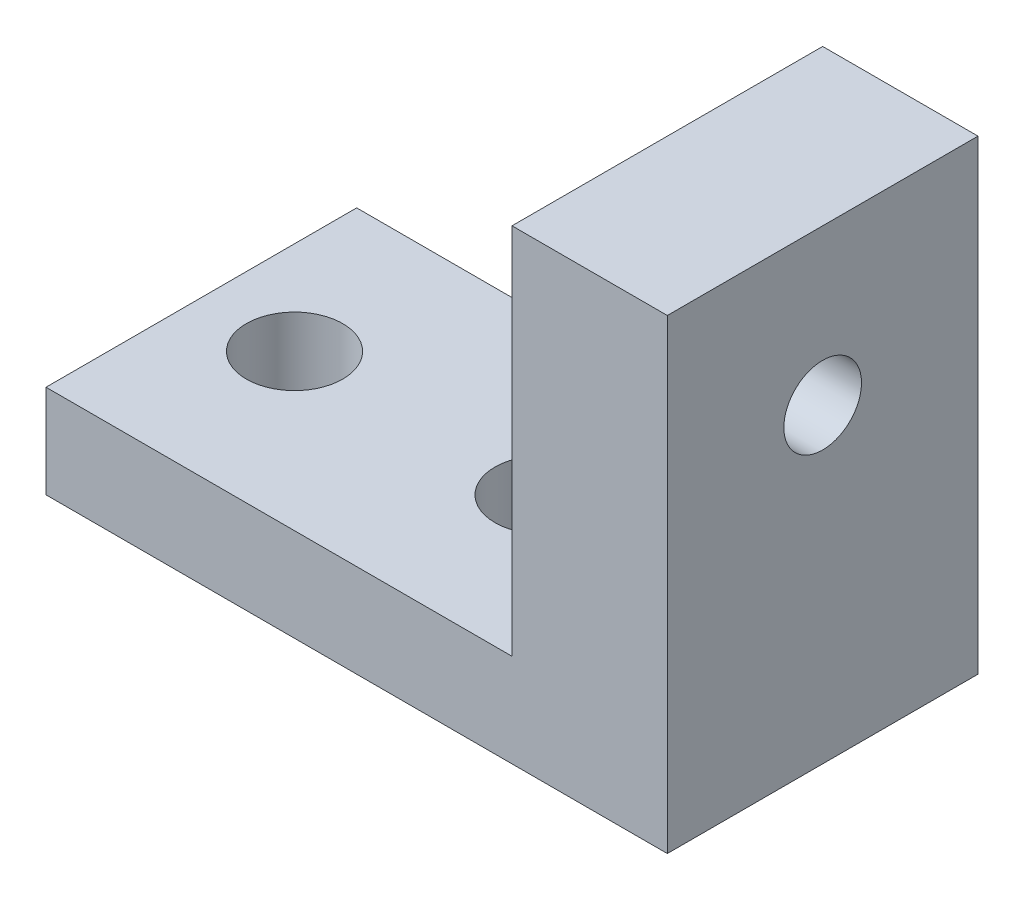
ISO-10303-21;
HEADER;
FILE_DESCRIPTION(('STEP AP214'),'2;1');
FILE_NAME('part.step','',(''),(''),'','','');
FILE_SCHEMA(('AUTOMOTIVE_DESIGN { 1 0 10303 214 1 1 1 1 }'));
ENDSEC;
DATA;
#1=APPLICATION_CONTEXT('core data for automotive mechanical design processes');
#2=APPLICATION_PROTOCOL_DEFINITION('international standard','automotive_design',2000,#1);
#3=PRODUCT_CONTEXT('',#1,'mechanical');
#4=PRODUCT('Part','Part','',(#3));
#5=PRODUCT_RELATED_PRODUCT_CATEGORY('part','',(#4));
#6=PRODUCT_DEFINITION_FORMATION('','',#4);
#7=PRODUCT_DEFINITION_CONTEXT('part definition',#1,'design');
#8=PRODUCT_DEFINITION('design','',#6,#7);
#9=PRODUCT_DEFINITION_SHAPE('','',#8);
#10=(LENGTH_UNIT() NAMED_UNIT(*) SI_UNIT(.MILLI.,.METRE.));
#11=(NAMED_UNIT(*) PLANE_ANGLE_UNIT() SI_UNIT($,.RADIAN.));
#12=(NAMED_UNIT(*) SI_UNIT($,.STERADIAN.) SOLID_ANGLE_UNIT());
#13=UNCERTAINTY_MEASURE_WITH_UNIT(LENGTH_MEASURE(1.E-05),#10,'distance_accuracy_value','');
#14=(GEOMETRIC_REPRESENTATION_CONTEXT(3) GLOBAL_UNCERTAINTY_ASSIGNED_CONTEXT((#13)) GLOBAL_UNIT_ASSIGNED_CONTEXT((#10,
#11,#12)) REPRESENTATION_CONTEXT('',''));
#15=CARTESIAN_POINT('',(0.,0.,0.));
#16=DIRECTION('',(0.,0.,1.));
#17=DIRECTION('',(1.,0.,0.));
#18=AXIS2_PLACEMENT_3D('',#15,#16,#17);
#19=CARTESIAN_POINT('',(20.,0.,0.));
#20=DIRECTION('',(0.,0.,-1.));
#21=DIRECTION('',(-1.,0.,0.));
#22=AXIS2_PLACEMENT_3D('',#19,#20,#21);
#23=PLANE('',#22);
#24=DIRECTION('',(-1.,0.,0.));
#25=VECTOR('',#24,1.);
#26=CARTESIAN_POINT('',(20.,15.,0.));
#27=LINE('',#26,#25);
#28=CARTESIAN_POINT('',(20.,15.,0.));
#29=VERTEX_POINT('',#28);
#30=CARTESIAN_POINT('',(15.,15.,0.));
#31=VERTEX_POINT('',#30);
#32=EDGE_CURVE('E137',#29,#31,#27,.T.);
#33=ORIENTED_EDGE('',*,*,#32,.T.);
#34=DIRECTION('',(0.,1.,0.));
#35=VECTOR('',#34,1.);
#36=CARTESIAN_POINT('',(15.,3.,0.));
#37=LINE('',#36,#35);
#38=CARTESIAN_POINT('',(15.,3.,0.));
#39=VERTEX_POINT('',#38);
#40=EDGE_CURVE('E117',#39,#31,#37,.T.);
#41=ORIENTED_EDGE('',*,*,#40,.F.);
#42=DIRECTION('',(1.,0.,0.));
#43=VECTOR('',#42,1.);
#44=CARTESIAN_POINT('',(0.,3.,0.));
#45=LINE('',#44,#43);
#46=CARTESIAN_POINT('',(0.,3.,0.));
#47=VERTEX_POINT('',#46);
#48=EDGE_CURVE('E98',#47,#39,#45,.T.);
#49=ORIENTED_EDGE('',*,*,#48,.F.);
#50=DIRECTION('',(0.,-1.,0.));
#51=VECTOR('',#50,1.);
#52=CARTESIAN_POINT('',(0.,0.,0.));
#53=LINE('',#52,#51);
#54=CARTESIAN_POINT('',(0.,0.,0.));
#55=VERTEX_POINT('',#54);
#56=EDGE_CURVE('E130',#47,#55,#53,.T.);
#57=ORIENTED_EDGE('',*,*,#56,.T.);
#58=DIRECTION('',(-1.,0.,0.));
#59=VECTOR('',#58,1.);
#60=CARTESIAN_POINT('',(20.,0.,0.));
#61=LINE('',#60,#59);
#62=CARTESIAN_POINT('',(20.,0.,0.));
#63=VERTEX_POINT('',#62);
#64=EDGE_CURVE('E11',#63,#55,#61,.T.);
#65=ORIENTED_EDGE('',*,*,#64,.F.);
#66=DIRECTION('',(0.,-1.,0.));
#67=VECTOR('',#66,1.);
#68=CARTESIAN_POINT('',(20.,0.,0.));
#69=LINE('',#68,#67);
#70=EDGE_CURVE('E131',#29,#63,#69,.T.);
#71=ORIENTED_EDGE('',*,*,#70,.F.);
#72=EDGE_LOOP('',(#33,#41,#49,#57,#65,#71));
#73=FACE_BOUND('',#72,.T.);
#74=ADVANCED_FACE('F36',(#73),#23,.F.);
#75=CARTESIAN_POINT('',(20.,0.,0.));
#76=DIRECTION('',(0.,1.,0.));
#77=DIRECTION('',(0.,0.,1.));
#78=AXIS2_PLACEMENT_3D('',#75,#76,#77);
#79=PLANE('',#78);
#80=CARTESIAN_POINT('',(3.,0.,-5.));
#81=DIRECTION('',(0.,1.,0.));
#82=DIRECTION('',(0.,0.,1.));
#83=AXIS2_PLACEMENT_3D('',#80,#81,#82);
#84=CIRCLE('',#83,1.55);
#85=CARTESIAN_POINT('',(3.,0.,-3.45));
#86=VERTEX_POINT('',#85);
#87=EDGE_CURVE('E180',#86,#86,#84,.T.);
#88=ORIENTED_EDGE('',*,*,#87,.T.);
#89=EDGE_LOOP('',(#88));
#90=FACE_BOUND('',#89,.T.);
#91=CARTESIAN_POINT('',(11.,0.,-5.));
#92=DIRECTION('',(0.,1.,0.));
#93=DIRECTION('',(0.,0.,1.));
#94=AXIS2_PLACEMENT_3D('',#91,#92,#93);
#95=CIRCLE('',#94,1.55);
#96=CARTESIAN_POINT('',(11.,0.,-3.45));
#97=VERTEX_POINT('',#96);
#98=EDGE_CURVE('E121',#97,#97,#95,.T.);
#99=ORIENTED_EDGE('',*,*,#98,.T.);
#100=EDGE_LOOP('',(#99));
#101=FACE_BOUND('',#100,.T.);
#102=DIRECTION('',(0.,0.,-1.));
#103=VECTOR('',#102,1.);
#104=CARTESIAN_POINT('',(0.,0.,0.));
#105=LINE('',#104,#103);
#106=CARTESIAN_POINT('',(0.,0.,-10.));
#107=VERTEX_POINT('',#106);
#108=EDGE_CURVE('E75',#55,#107,#105,.T.);
#109=ORIENTED_EDGE('',*,*,#108,.T.);
#110=DIRECTION('',(-1.,0.,0.));
#111=VECTOR('',#110,1.);
#112=CARTESIAN_POINT('',(20.,0.,-10.));
#113=LINE('',#112,#111);
#114=CARTESIAN_POINT('',(20.,0.,-10.));
#115=VERTEX_POINT('',#114);
#116=EDGE_CURVE('E44',#115,#107,#113,.T.);
#117=ORIENTED_EDGE('',*,*,#116,.F.);
#118=DIRECTION('',(0.,0.,-1.));
#119=VECTOR('',#118,1.);
#120=CARTESIAN_POINT('',(20.,0.,0.));
#121=LINE('',#120,#119);
#122=EDGE_CURVE('E80',#63,#115,#121,.T.);
#123=ORIENTED_EDGE('',*,*,#122,.F.);
#124=ORIENTED_EDGE('',*,*,#64,.T.);
#125=EDGE_LOOP('',(#109,#117,#123,#124));
#126=FACE_BOUND('',#125,.T.);
#127=ADVANCED_FACE('F168',(#90,#101,#126),#79,.F.);
#128=CARTESIAN_POINT('',(20.,0.,-10.));
#129=DIRECTION('',(0.,0.,1.));
#130=DIRECTION('',(0.,-1.,0.));
#131=AXIS2_PLACEMENT_3D('',#128,#129,#130);
#132=PLANE('',#131);
#133=DIRECTION('',(1.,0.,0.));
#134=VECTOR('',#133,1.);
#135=CARTESIAN_POINT('',(0.,3.,-10.));
#136=LINE('',#135,#134);
#137=CARTESIAN_POINT('',(0.,3.,-10.));
#138=VERTEX_POINT('',#137);
#139=CARTESIAN_POINT('',(15.,3.,-10.));
#140=VERTEX_POINT('',#139);
#141=EDGE_CURVE('E51',#138,#140,#136,.T.);
#142=ORIENTED_EDGE('',*,*,#141,.T.);
#143=DIRECTION('',(0.,1.,0.));
#144=VECTOR('',#143,1.);
#145=CARTESIAN_POINT('',(15.,3.,-10.));
#146=LINE('',#145,#144);
#147=CARTESIAN_POINT('',(15.,15.,-10.));
#148=VERTEX_POINT('',#147);
#149=EDGE_CURVE('E105',#140,#148,#146,.T.);
#150=ORIENTED_EDGE('',*,*,#149,.T.);
#151=DIRECTION('',(-1.,0.,0.));
#152=VECTOR('',#151,1.);
#153=CARTESIAN_POINT('',(20.,15.,-10.));
#154=LINE('',#153,#152);
#155=CARTESIAN_POINT('',(20.,15.,-10.));
#156=VERTEX_POINT('',#155);
#157=EDGE_CURVE('E143',#156,#148,#154,.T.);
#158=ORIENTED_EDGE('',*,*,#157,.F.);
#159=DIRECTION('',(0.,1.,0.));
#160=VECTOR('',#159,1.);
#161=CARTESIAN_POINT('',(20.,0.,-10.));
#162=LINE('',#161,#160);
#163=EDGE_CURVE('E134',#115,#156,#162,.T.);
#164=ORIENTED_EDGE('',*,*,#163,.F.);
#165=ORIENTED_EDGE('',*,*,#116,.T.);
#166=DIRECTION('',(0.,1.,0.));
#167=VECTOR('',#166,1.);
#168=CARTESIAN_POINT('',(0.,0.,-10.));
#169=LINE('',#168,#167);
#170=EDGE_CURVE('E116',#107,#138,#169,.T.);
#171=ORIENTED_EDGE('',*,*,#170,.T.);
#172=EDGE_LOOP('',(#142,#150,#158,#164,#165,#171));
#173=FACE_BOUND('',#172,.T.);
#174=ADVANCED_FACE('F114',(#173),#132,.F.);
#175=CARTESIAN_POINT('',(20.,15.,0.));
#176=DIRECTION('',(0.,-1.,0.));
#177=DIRECTION('',(0.,0.,-1.));
#178=AXIS2_PLACEMENT_3D('',#175,#176,#177);
#179=PLANE('',#178);
#180=ORIENTED_EDGE('',*,*,#157,.T.);
#181=DIRECTION('',(0.,0.,1.));
#182=VECTOR('',#181,1.);
#183=CARTESIAN_POINT('',(15.,15.,-10.));
#184=LINE('',#183,#182);
#185=EDGE_CURVE('E101',#148,#31,#184,.T.);
#186=ORIENTED_EDGE('',*,*,#185,.T.);
#187=ORIENTED_EDGE('',*,*,#32,.F.);
#188=DIRECTION('',(0.,0.,1.));
#189=VECTOR('',#188,1.);
#190=CARTESIAN_POINT('',(20.,15.,0.));
#191=LINE('',#190,#189);
#192=EDGE_CURVE('E60',#156,#29,#191,.T.);
#193=ORIENTED_EDGE('',*,*,#192,.F.);
#194=EDGE_LOOP('',(#180,#186,#187,#193));
#195=FACE_BOUND('',#194,.T.);
#196=ADVANCED_FACE('F153',(#195),#179,.F.);
#197=CARTESIAN_POINT('',(20.,0.,0.));
#198=DIRECTION('',(-1.,0.,0.));
#199=DIRECTION('',(0.,0.,1.));
#200=AXIS2_PLACEMENT_3D('',#197,#198,#199);
#201=PLANE('',#200);
#202=CARTESIAN_POINT('',(20.,10.,-5.00000000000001));
#203=DIRECTION('',(1.,0.,0.));
#204=DIRECTION('',(0.,0.,-1.));
#205=AXIS2_PLACEMENT_3D('',#202,#203,#204);
#206=CIRCLE('',#205,1.25);
#207=CARTESIAN_POINT('',(20.,10.,-6.25));
#208=VERTEX_POINT('',#207);
#209=EDGE_CURVE('E127',#208,#208,#206,.T.);
#210=ORIENTED_EDGE('',*,*,#209,.F.);
#211=EDGE_LOOP('',(#210));
#212=FACE_BOUND('',#211,.T.);
#213=ORIENTED_EDGE('',*,*,#70,.T.);
#214=ORIENTED_EDGE('',*,*,#122,.T.);
#215=ORIENTED_EDGE('',*,*,#163,.T.);
#216=ORIENTED_EDGE('',*,*,#192,.T.);
#217=EDGE_LOOP('',(#213,#214,#215,#216));
#218=FACE_BOUND('',#217,.T.);
#219=ADVANCED_FACE('F154',(#212,#218),#201,.F.);
#220=CARTESIAN_POINT('',(0.,0.,0.));
#221=DIRECTION('',(-1.,0.,0.));
#222=DIRECTION('',(0.,0.,1.));
#223=AXIS2_PLACEMENT_3D('',#220,#221,#222);
#224=PLANE('',#223);
#225=DIRECTION('',(0.,0.,1.));
#226=VECTOR('',#225,1.);
#227=CARTESIAN_POINT('',(0.,3.,-10.));
#228=LINE('',#227,#226);
#229=EDGE_CURVE('E102',#138,#47,#228,.T.);
#230=ORIENTED_EDGE('',*,*,#229,.F.);
#231=ORIENTED_EDGE('',*,*,#170,.F.);
#232=ORIENTED_EDGE('',*,*,#108,.F.);
#233=ORIENTED_EDGE('',*,*,#56,.F.);
#234=EDGE_LOOP('',(#230,#231,#232,#233));
#235=FACE_BOUND('',#234,.T.);
#236=ADVANCED_FACE('F147',(#235),#224,.T.);
#237=CARTESIAN_POINT('',(20.,10.,-5.00000000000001));
#238=DIRECTION('',(1.,0.,0.));
#239=DIRECTION('',(0.,0.,-1.));
#240=AXIS2_PLACEMENT_3D('',#237,#238,#239);
#241=CYLINDRICAL_SURFACE('',#240,1.25);
#242=CARTESIAN_POINT('',(15.,10.,-5.00000000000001));
#243=DIRECTION('',(1.,0.,0.));
#244=DIRECTION('',(0.,0.,-1.));
#245=AXIS2_PLACEMENT_3D('',#242,#243,#244);
#246=CIRCLE('',#245,1.25);
#247=CARTESIAN_POINT('',(15.,10.,-6.25));
#248=VERTEX_POINT('',#247);
#249=EDGE_CURVE('E39',#248,#248,#246,.F.);
#250=ORIENTED_EDGE('',*,*,#249,.T.);
#251=EDGE_LOOP('',(#250));
#252=FACE_BOUND('',#251,.T.);
#253=ORIENTED_EDGE('',*,*,#209,.T.);
#254=EDGE_LOOP('',(#253));
#255=FACE_BOUND('',#254,.T.);
#256=ADVANCED_FACE('F162',(#252,#255),#241,.F.);
#257=CARTESIAN_POINT('',(15.,3.,-10.));
#258=DIRECTION('',(1.,0.,0.));
#259=DIRECTION('',(0.,0.,-1.));
#260=AXIS2_PLACEMENT_3D('',#257,#258,#259);
#261=PLANE('',#260);
#262=ORIENTED_EDGE('',*,*,#40,.T.);
#263=ORIENTED_EDGE('',*,*,#185,.F.);
#264=ORIENTED_EDGE('',*,*,#149,.F.);
#265=DIRECTION('',(0.,0.,1.));
#266=VECTOR('',#265,1.);
#267=CARTESIAN_POINT('',(15.,3.,-10.));
#268=LINE('',#267,#266);
#269=EDGE_CURVE('E94',#140,#39,#268,.T.);
#270=ORIENTED_EDGE('',*,*,#269,.T.);
#271=EDGE_LOOP('',(#262,#263,#264,#270));
#272=FACE_BOUND('',#271,.T.);
#273=ORIENTED_EDGE('',*,*,#249,.F.);
#274=EDGE_LOOP('',(#273));
#275=FACE_BOUND('',#274,.T.);
#276=ADVANCED_FACE('F106',(#272,#275),#261,.F.);
#277=CARTESIAN_POINT('',(0.,3.,-10.));
#278=DIRECTION('',(0.,-1.,0.));
#279=DIRECTION('',(1.,0.,0.));
#280=AXIS2_PLACEMENT_3D('',#277,#278,#279);
#281=PLANE('',#280);
#282=CARTESIAN_POINT('',(3.,3.,-5.));
#283=DIRECTION('',(0.,1.,0.));
#284=DIRECTION('',(0.,0.,1.));
#285=AXIS2_PLACEMENT_3D('',#282,#283,#284);
#286=CIRCLE('',#285,1.54999999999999);
#287=CARTESIAN_POINT('',(3.,3.,-3.45000000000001));
#288=VERTEX_POINT('',#287);
#289=EDGE_CURVE('E188',#288,#288,#286,.T.);
#290=ORIENTED_EDGE('',*,*,#289,.F.);
#291=EDGE_LOOP('',(#290));
#292=FACE_BOUND('',#291,.T.);
#293=CARTESIAN_POINT('',(11.,3.,-5.));
#294=DIRECTION('',(0.,1.,0.));
#295=DIRECTION('',(0.,0.,1.));
#296=AXIS2_PLACEMENT_3D('',#293,#294,#295);
#297=CIRCLE('',#296,1.54999999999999);
#298=CARTESIAN_POINT('',(11.,3.,-3.45000000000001));
#299=VERTEX_POINT('',#298);
#300=EDGE_CURVE('E184',#299,#299,#297,.T.);
#301=ORIENTED_EDGE('',*,*,#300,.F.);
#302=EDGE_LOOP('',(#301));
#303=FACE_BOUND('',#302,.T.);
#304=ORIENTED_EDGE('',*,*,#48,.T.);
#305=ORIENTED_EDGE('',*,*,#269,.F.);
#306=ORIENTED_EDGE('',*,*,#141,.F.);
#307=ORIENTED_EDGE('',*,*,#229,.T.);
#308=EDGE_LOOP('',(#304,#305,#306,#307));
#309=FACE_BOUND('',#308,.T.);
#310=ADVANCED_FACE('F96',(#292,#303,#309),#281,.F.);
#311=CARTESIAN_POINT('',(11.,3.,-5.));
#312=DIRECTION('',(0.,1.,0.));
#313=DIRECTION('',(0.,0.,1.));
#314=AXIS2_PLACEMENT_3D('',#311,#312,#313);
#315=CYLINDRICAL_SURFACE('',#314,1.54999999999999);
#316=ORIENTED_EDGE('',*,*,#98,.F.);
#317=EDGE_LOOP('',(#316));
#318=FACE_BOUND('',#317,.T.);
#319=ORIENTED_EDGE('',*,*,#300,.T.);
#320=EDGE_LOOP('',(#319));
#321=FACE_BOUND('',#320,.T.);
#322=ADVANCED_FACE('F198',(#318,#321),#315,.F.);
#323=CARTESIAN_POINT('',(3.,3.,-5.));
#324=DIRECTION('',(0.,1.,0.));
#325=DIRECTION('',(0.,0.,1.));
#326=AXIS2_PLACEMENT_3D('',#323,#324,#325);
#327=CYLINDRICAL_SURFACE('',#326,1.54999999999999);
#328=ORIENTED_EDGE('',*,*,#87,.F.);
#329=EDGE_LOOP('',(#328));
#330=FACE_BOUND('',#329,.T.);
#331=ORIENTED_EDGE('',*,*,#289,.T.);
#332=EDGE_LOOP('',(#331));
#333=FACE_BOUND('',#332,.T.);
#334=ADVANCED_FACE('F194',(#330,#333),#327,.F.);
#335=CLOSED_SHELL('',(#74,#127,#174,#196,#219,#236,#256,#276,#310,#322,#334));
#336=MANIFOLD_SOLID_BREP('B2',#335);
#337=ADVANCED_BREP_SHAPE_REPRESENTATION('',(#18,#336),#14);
#338=SHAPE_DEFINITION_REPRESENTATION(#9,#337);
ENDSEC;
END-ISO-10303-21;
